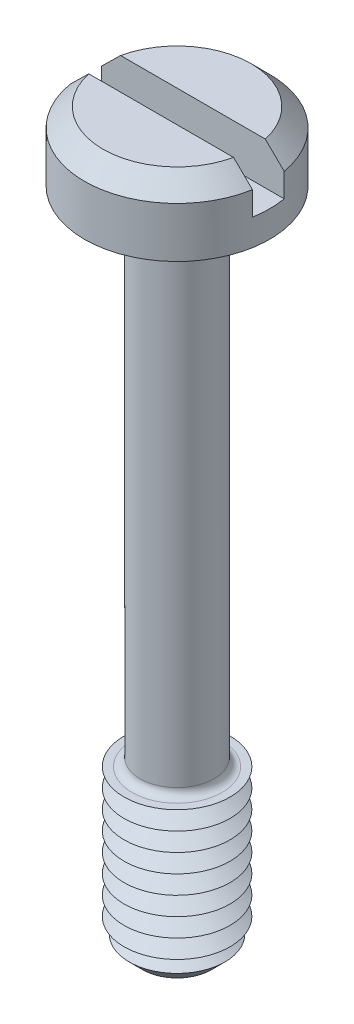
ISO-10303-21;
HEADER;
FILE_DESCRIPTION(('STEP AP214'),'2;1');
FILE_NAME('part.step','',(''),(''),'','','');
FILE_SCHEMA(('AUTOMOTIVE_DESIGN { 1 0 10303 214 1 1 1 1 }'));
ENDSEC;
DATA;
#1=APPLICATION_CONTEXT('core data for automotive mechanical design processes');
#2=APPLICATION_PROTOCOL_DEFINITION('international standard','automotive_design',2000,#1);
#3=PRODUCT_CONTEXT('',#1,'mechanical');
#4=PRODUCT('Part','Part','',(#3));
#5=PRODUCT_RELATED_PRODUCT_CATEGORY('part','',(#4));
#6=PRODUCT_DEFINITION_FORMATION('','',#4);
#7=PRODUCT_DEFINITION_CONTEXT('part definition',#1,'design');
#8=PRODUCT_DEFINITION('design','',#6,#7);
#9=PRODUCT_DEFINITION_SHAPE('','',#8);
#10=(LENGTH_UNIT() NAMED_UNIT(*) SI_UNIT(.MILLI.,.METRE.));
#11=(NAMED_UNIT(*) PLANE_ANGLE_UNIT() SI_UNIT($,.RADIAN.));
#12=(NAMED_UNIT(*) SI_UNIT($,.STERADIAN.) SOLID_ANGLE_UNIT());
#13=UNCERTAINTY_MEASURE_WITH_UNIT(LENGTH_MEASURE(1.E-05),#10,'distance_accuracy_value','');
#14=(GEOMETRIC_REPRESENTATION_CONTEXT(3) GLOBAL_UNCERTAINTY_ASSIGNED_CONTEXT((#13)) GLOBAL_UNIT_ASSIGNED_CONTEXT((#10,
#11,#12)) REPRESENTATION_CONTEXT('',''));
#15=CARTESIAN_POINT('',(0.,0.,0.));
#16=DIRECTION('',(0.,0.,1.));
#17=DIRECTION('',(1.,0.,0.));
#18=AXIS2_PLACEMENT_3D('',#15,#16,#17);
#19=CARTESIAN_POINT('',(0.,2.6,0.));
#20=DIRECTION('',(0.,1.,0.));
#21=DIRECTION('',(0.,0.,1.));
#22=AXIS2_PLACEMENT_3D('',#19,#20,#21);
#23=PLANE('',#22);
#24=DIRECTION('',(-1.,0.,0.));
#25=VECTOR('',#24,1.);
#26=CARTESIAN_POINT('',(3.5,2.6,-0.6));
#27=LINE('',#26,#25);
#28=CARTESIAN_POINT('',(2.73495886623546,2.6,-0.6));
#29=VERTEX_POINT('',#28);
#30=CARTESIAN_POINT('',(-2.73495886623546,2.6,-0.6));
#31=VERTEX_POINT('',#30);
#32=EDGE_CURVE('E110',#29,#31,#27,.T.);
#33=ORIENTED_EDGE('',*,*,#32,.F.);
#34=CARTESIAN_POINT('',(0.,2.6,0.));
#35=DIRECTION('',(0.,1.,0.));
#36=DIRECTION('',(0.,0.,1.));
#37=AXIS2_PLACEMENT_3D('',#34,#35,#36);
#38=CIRCLE('',#37,2.79999999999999);
#39=EDGE_CURVE('E113',#29,#31,#38,.T.);
#40=ORIENTED_EDGE('',*,*,#39,.T.);
#41=EDGE_LOOP('',(#33,#40));
#42=FACE_BOUND('',#41,.T.);
#43=ADVANCED_FACE('F39',(#42),#23,.T.);
#44=CARTESIAN_POINT('',(0.,2.6,0.));
#45=DIRECTION('',(0.,-1.,0.));
#46=DIRECTION('',(0.,0.,-1.));
#47=AXIS2_PLACEMENT_3D('',#44,#45,#46);
#48=CONICAL_SURFACE('',#47,2.79999999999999,0.785398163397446);
#49=CARTESIAN_POINT('',(7.69779986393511,-2.32114776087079,-0.6));
#50=CARTESIAN_POINT('',(7.42456340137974,-2.04874480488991,-0.6));
#51=CARTESIAN_POINT('',(7.15128998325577,-1.77637887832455,-0.6));
#52=CARTESIAN_POINT('',(6.6046077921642,-1.23176088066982,-0.6));
#53=CARTESIAN_POINT('',(6.3311990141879,-0.959508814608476,-0.6));
#54=CARTESIAN_POINT('',(5.78393918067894,-0.414914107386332,-0.6));
#55=CARTESIAN_POINT('',(5.51008795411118,-0.142571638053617,-0.6));
#56=CARTESIAN_POINT('',(4.96212493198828,0.401829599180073,-0.6));
#57=CARTESIAN_POINT('',(4.68801314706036,0.673888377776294,-0.6));
#58=CARTESIAN_POINT('',(4.15230810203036,1.204717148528,-0.6));
#59=CARTESIAN_POINT('',(3.8907352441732,1.4635077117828,-0.6));
#60=CARTESIAN_POINT('',(3.49781694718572,1.85115830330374,-0.6));
#61=CARTESIAN_POINT('',(3.36674319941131,1.98029362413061,-0.6));
#62=CARTESIAN_POINT('',(3.10433907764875,2.23830030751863,-0.6));
#63=CARTESIAN_POINT('',(2.97300870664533,2.36717167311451,-0.6));
#64=CARTESIAN_POINT('',(2.71005235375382,2.62445652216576,-0.6));
#65=CARTESIAN_POINT('',(2.57842659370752,2.75287023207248,-0.6));
#66=CARTESIAN_POINT('',(2.31459302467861,3.00911021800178,-0.6));
#67=CARTESIAN_POINT('',(2.1823851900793,3.13693646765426,-0.6));
#68=CARTESIAN_POINT('',(1.91706128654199,3.39159289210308,-0.6));
#69=CARTESIAN_POINT('',(1.78394541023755,3.51842326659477,-0.6));
#70=CARTESIAN_POINT('',(1.58297454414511,3.70728046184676,-0.6));
#71=CARTESIAN_POINT('',(1.51577053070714,3.76999922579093,-0.6));
#72=CARTESIAN_POINT('',(1.38073587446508,3.89475766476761,-0.6));
#73=CARTESIAN_POINT('',(1.31290524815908,3.95679735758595,-0.6));
#74=CARTESIAN_POINT('',(1.20662362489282,4.05253127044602,-0.6));
#75=CARTESIAN_POINT('',(1.16849592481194,4.08658409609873,-0.6));
#76=CARTESIAN_POINT('',(1.09186306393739,4.15427097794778,-0.6));
#77=CARTESIAN_POINT('',(1.05335786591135,4.18790499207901,-0.6));
#78=CARTESIAN_POINT('',(0.97556016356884,4.25487029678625,-0.6));
#79=CARTESIAN_POINT('',(0.936263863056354,4.28819718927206,-0.6));
#80=CARTESIAN_POINT('',(0.85702368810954,4.3540539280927,-0.6));
#81=CARTESIAN_POINT('',(0.817079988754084,4.38658398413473,-0.6));
#82=CARTESIAN_POINT('',(0.735932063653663,4.45080389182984,-0.6));
#83=CARTESIAN_POINT('',(0.694719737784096,4.48248357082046,-0.6));
#84=CARTESIAN_POINT('',(0.611023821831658,4.54411116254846,-0.6));
#85=CARTESIAN_POINT('',(0.568540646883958,4.5740596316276,-0.6));
#86=CARTESIAN_POINT('',(0.482031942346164,4.63104137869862,-0.6));
#87=CARTESIAN_POINT('',(0.438018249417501,4.65809235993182,-0.6));
#88=CARTESIAN_POINT('',(0.347545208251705,4.70764477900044,-0.6));
#89=CARTESIAN_POINT('',(0.301093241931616,4.73015905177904,-0.6));
#90=CARTESIAN_POINT('',(0.216840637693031,4.76288589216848,-0.6));
#91=CARTESIAN_POINT('',(0.179711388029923,4.77476119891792,-0.6));
#92=CARTESIAN_POINT('',(0.104069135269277,4.79214056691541,-0.6));
#93=CARTESIAN_POINT('',(0.0655630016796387,4.79767265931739,-0.6));
#94=CARTESIAN_POINT('',(-0.0121083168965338,4.80113734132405,-0.6));
#95=CARTESIAN_POINT('',(-0.0512762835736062,4.79901215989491,-0.6));
#96=CARTESIAN_POINT('',(-0.128601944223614,4.78758103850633,-0.6));
#97=CARTESIAN_POINT('',(-0.166755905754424,4.77825158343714,-0.6));
#98=CARTESIAN_POINT('',(-0.23998525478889,4.75468984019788,-0.6));
#99=CARTESIAN_POINT('',(-0.27512131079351,4.74063623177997,-0.6));
#100=CARTESIAN_POINT('',(-0.343859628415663,4.70912771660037,-0.6));
#101=CARTESIAN_POINT('',(-0.377459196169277,4.6916670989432,-0.6));
#102=CARTESIAN_POINT('',(-0.443620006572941,4.65431398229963,-0.6));
#103=CARTESIAN_POINT('',(-0.476170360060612,4.63440256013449,-0.6));
#104=CARTESIAN_POINT('',(-0.540208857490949,4.59301144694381,-0.6));
#105=CARTESIAN_POINT('',(-0.571697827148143,4.57153301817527,-0.6));
#106=CARTESIAN_POINT('',(-0.636426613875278,4.5256571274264,-0.6));
#107=CARTESIAN_POINT('',(-0.669598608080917,4.50116466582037,-0.6));
#108=CARTESIAN_POINT('',(-0.735238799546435,4.45125092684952,-0.6));
#109=CARTESIAN_POINT('',(-0.767706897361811,4.42582951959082,-0.6));
#110=CARTESIAN_POINT('',(-0.864340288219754,4.34853769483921,-0.6));
#111=CARTESIAN_POINT('',(-0.927700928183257,4.29566444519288,-0.6));
#112=CARTESIAN_POINT('',(-1.05322030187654,4.18829389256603,-0.6));
#113=CARTESIAN_POINT('',(-1.115376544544,4.13379371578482,-0.6));
#114=CARTESIAN_POINT('',(-1.23879800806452,4.02383276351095,-0.6));
#115=CARTESIAN_POINT('',(-1.30006349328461,3.96837228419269,-0.6));
#116=CARTESIAN_POINT('',(-1.42182653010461,3.85695373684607,-0.6));
#117=CARTESIAN_POINT('',(-1.48232573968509,3.80099747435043,-0.6));
#118=CARTESIAN_POINT('',(-1.60290045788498,3.68862177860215,-0.6));
#119=CARTESIAN_POINT('',(-1.66297593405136,3.63220231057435,-0.6));
#120=CARTESIAN_POINT('',(-1.842594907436,3.4625819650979,-0.6));
#121=CARTESIAN_POINT('',(-1.96167258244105,3.3488883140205,-0.6));
#122=CARTESIAN_POINT('',(-2.19942862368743,3.12043467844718,-0.6));
#123=CARTESIAN_POINT('',(-2.31810499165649,3.00567262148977,-0.6));
#124=CARTESIAN_POINT('',(-2.55498513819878,2.77566147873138,-0.6));
#125=CARTESIAN_POINT('',(-2.67318891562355,2.66041239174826,-0.6));
#126=CARTESIAN_POINT('',(-3.02733776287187,2.31418176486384,-0.6));
#127=CARTESIAN_POINT('',(-3.26281496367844,2.08272206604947,-0.6));
#128=CARTESIAN_POINT('',(-3.73326607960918,1.61902814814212,-0.6));
#129=CARTESIAN_POINT('',(-3.96823963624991,1.38679356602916,-0.6));
#130=CARTESIAN_POINT('',(-4.43780370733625,0.921942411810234,-0.6));
#131=CARTESIAN_POINT('',(-4.67239422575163,0.689325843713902,-0.6));
#132=CARTESIAN_POINT('',(-5.13982382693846,0.225350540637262,-0.6));
#133=CARTESIAN_POINT('',(-5.37266445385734,-0.0060066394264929,-0.6));
#134=CARTESIAN_POINT('',(-5.8381854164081,-0.46888381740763,-0.6));
#135=CARTESIAN_POINT('',(-6.07086575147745,-0.700403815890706,-0.6));
#136=CARTESIAN_POINT('',(-6.5359692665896,-1.16341429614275,-0.6));
#137=CARTESIAN_POINT('',(-6.76839251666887,-1.39490470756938,-0.6));
#138=CARTESIAN_POINT('',(-7.23315324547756,-1.85796986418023,-0.6));
#139=CARTESIAN_POINT('',(-7.46549072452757,-2.08954460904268,-0.6));
#140=CARTESIAN_POINT('',(-7.69779986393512,-2.32114776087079,-0.6));
#141=B_SPLINE_CURVE_WITH_KNOTS('',3,(#49,#50,#51,#52,#53,#54,#55,#56,#57,#58,#59,#60,#61,#62,
#63,#64,#65,#66,#67,#68,#69,#70,#71,#72,#73,#74,#75,#76,#77,#78,#79,#80,#81,#82,#83,#84,#85,#86,
#87,#88,#89,#90,#91,#92,#93,#94,#95,#96,#97,#98,#99,#100,#101,#102,#103,#104,#105,#106,#107,
#108,#109,#110,#111,#112,#113,#114,#115,#116,#117,#118,#119,#120,#121,#122,#123,#124,#125,#126,
#127,#128,#129,#130,#131,#132,#133,#134,#135,#136,#137,#138,#139,#140),.UNSPECIFIED.,.F.,.F.,(4,
2,2,2,2,2,2,2,2,2,2,2,2,2,2,2,2,2,2,2,2,2,2,2,2,2,2,2,2,2,2,2,2,2,2,2,2,2,2,2,2,2,2,2,2,4),(0.,
1.15747738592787,2.31500139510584,3.47365747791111,4.63226817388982,5.73614050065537,
6.28814234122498,6.84013779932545,7.39180548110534,7.94349768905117,8.49507629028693,
8.7708456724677,9.04660781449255,9.19996738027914,9.35334222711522,9.50791164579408,
9.66243993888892,9.81835637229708,9.9742224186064,10.1290741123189,10.2834813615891,
10.4000294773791,10.5160605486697,10.6329688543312,10.7502603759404,10.8635386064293,
10.9770083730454,11.0914168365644,11.205734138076,11.3294140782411,11.4531113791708,
11.7006314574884,11.9486181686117,12.196529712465,12.4437540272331,12.6909970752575,
13.184904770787,13.6801705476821,14.1754375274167,15.1659939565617,16.1571087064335,
17.1482131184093,18.1329303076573,19.1176509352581,20.1017623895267,21.0858701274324),.UNSPECIFIED.);
#142=CARTESIAN_POINT('',(3.44818792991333,1.89999999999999,-0.6));
#143=VERTEX_POINT('',#142);
#144=EDGE_CURVE('E260',#143,#29,#141,.T.);
#145=ORIENTED_EDGE('',*,*,#144,.F.);
#146=CARTESIAN_POINT('',(0.,1.89999999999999,0.));
#147=DIRECTION('',(0.,1.,0.));
#148=DIRECTION('',(0.,0.,1.));
#149=AXIS2_PLACEMENT_3D('',#146,#147,#148);
#150=CIRCLE('',#149,3.5);
#151=CARTESIAN_POINT('',(-3.44818792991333,1.89999999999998,-0.6));
#152=VERTEX_POINT('',#151);
#153=EDGE_CURVE('E128',#152,#143,#150,.F.);
#154=ORIENTED_EDGE('',*,*,#153,.F.);
#155=EDGE_CURVE('E102',#31,#152,#141,.T.);
#156=ORIENTED_EDGE('',*,*,#155,.F.);
#157=ORIENTED_EDGE('',*,*,#39,.F.);
#158=EDGE_LOOP('',(#145,#154,#156,#157));
#159=FACE_BOUND('',#158,.T.);
#160=ADVANCED_FACE('F222',(#159),#48,.T.);
#161=CARTESIAN_POINT('',(0.,-25.,0.));
#162=DIRECTION('',(0.,1.,0.));
#163=DIRECTION('',(0.,0.,1.));
#164=AXIS2_PLACEMENT_3D('',#161,#162,#163);
#165=CYLINDRICAL_SURFACE('',#164,1.4);
#166=CARTESIAN_POINT('',(0.,-18.7,0.));
#167=DIRECTION('',(0.,-1.,0.));
#168=DIRECTION('',(0.,0.,-1.));
#169=AXIS2_PLACEMENT_3D('',#166,#167,#168);
#170=CIRCLE('',#169,1.4);
#171=CARTESIAN_POINT('',(0.,-18.7,-1.4));
#172=VERTEX_POINT('',#171);
#173=EDGE_CURVE('E123',#172,#172,#170,.F.);
#174=ORIENTED_EDGE('',*,*,#173,.T.);
#175=EDGE_LOOP('',(#174));
#176=FACE_BOUND('',#175,.T.);
#177=CARTESIAN_POINT('',(0.,-0.300000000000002,0.));
#178=DIRECTION('',(0.,1.,0.));
#179=DIRECTION('',(0.,0.,1.));
#180=AXIS2_PLACEMENT_3D('',#177,#178,#179);
#181=CIRCLE('',#180,1.4);
#182=CARTESIAN_POINT('',(0.,-0.300000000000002,1.4));
#183=VERTEX_POINT('',#182);
#184=EDGE_CURVE('E366',#183,#183,#181,.F.);
#185=ORIENTED_EDGE('',*,*,#184,.T.);
#186=EDGE_LOOP('',(#185));
#187=FACE_BOUND('',#186,.T.);
#188=ADVANCED_FACE('F218',(#176,#187),#165,.T.);
#189=CARTESIAN_POINT('',(0.,2.6,0.));
#190=DIRECTION('',(0.,-1.,0.));
#191=DIRECTION('',(0.,0.,-1.));
#192=AXIS2_PLACEMENT_3D('',#189,#190,#191);
#193=CYLINDRICAL_SURFACE('',#192,3.5);
#194=ORIENTED_EDGE('',*,*,#153,.T.);
#195=DIRECTION('',(0.,-1.,0.));
#196=VECTOR('',#195,1.);
#197=CARTESIAN_POINT('',(3.44818792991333,2.6,-0.6));
#198=LINE('',#197,#196);
#199=CARTESIAN_POINT('',(3.44818792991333,1.,-0.6));
#200=VERTEX_POINT('',#199);
#201=EDGE_CURVE('E64',#143,#200,#198,.T.);
#202=ORIENTED_EDGE('',*,*,#201,.T.);
#203=CARTESIAN_POINT('',(0.,1.,0.));
#204=DIRECTION('',(0.,1.,0.));
#205=DIRECTION('',(0.,0.,1.));
#206=AXIS2_PLACEMENT_3D('',#203,#204,#205);
#207=CIRCLE('',#206,3.5);
#208=CARTESIAN_POINT('',(3.44818792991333,1.,0.6));
#209=VERTEX_POINT('',#208);
#210=EDGE_CURVE('E11',#209,#200,#207,.T.);
#211=ORIENTED_EDGE('',*,*,#210,.F.);
#212=DIRECTION('',(0.,-1.,0.));
#213=VECTOR('',#212,1.);
#214=CARTESIAN_POINT('',(3.44818792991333,2.6,0.6));
#215=LINE('',#214,#213);
#216=CARTESIAN_POINT('',(3.44818792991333,1.89999999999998,0.6));
#217=VERTEX_POINT('',#216);
#218=EDGE_CURVE('E276',#209,#217,#215,.F.);
#219=ORIENTED_EDGE('',*,*,#218,.T.);
#220=CARTESIAN_POINT('',(-3.44818792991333,1.89999999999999,0.6));
#221=VERTEX_POINT('',#220);
#222=EDGE_CURVE('E120',#217,#221,#150,.F.);
#223=ORIENTED_EDGE('',*,*,#222,.T.);
#224=DIRECTION('',(0.,-1.,0.));
#225=VECTOR('',#224,1.);
#226=CARTESIAN_POINT('',(-3.44818792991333,2.6,0.6));
#227=LINE('',#226,#225);
#228=CARTESIAN_POINT('',(-3.44818792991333,1.,0.6));
#229=VERTEX_POINT('',#228);
#230=EDGE_CURVE('E96',#221,#229,#227,.T.);
#231=ORIENTED_EDGE('',*,*,#230,.T.);
#232=CARTESIAN_POINT('',(-3.44818792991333,1.,-0.6));
#233=VERTEX_POINT('',#232);
#234=EDGE_CURVE('E44',#233,#229,#207,.T.);
#235=ORIENTED_EDGE('',*,*,#234,.F.);
#236=DIRECTION('',(0.,-1.,0.));
#237=VECTOR('',#236,1.);
#238=CARTESIAN_POINT('',(-3.44818792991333,2.6,-0.6));
#239=LINE('',#238,#237);
#240=EDGE_CURVE('E281',#233,#152,#239,.F.);
#241=ORIENTED_EDGE('',*,*,#240,.T.);
#242=EDGE_LOOP('',(#194,#202,#211,#219,#223,#231,#235,#241));
#243=FACE_BOUND('',#242,.T.);
#244=CARTESIAN_POINT('',(0.,0.,0.));
#245=DIRECTION('',(0.,1.,0.));
#246=DIRECTION('',(0.,0.,1.));
#247=AXIS2_PLACEMENT_3D('',#244,#245,#246);
#248=CIRCLE('',#247,3.5);
#249=CARTESIAN_POINT('',(0.,0.,3.5));
#250=VERTEX_POINT('',#249);
#251=EDGE_CURVE('E353',#250,#250,#248,.T.);
#252=ORIENTED_EDGE('',*,*,#251,.T.);
#253=EDGE_LOOP('',(#252));
#254=FACE_BOUND('',#253,.T.);
#255=ADVANCED_FACE('F221',(#243,#254),#193,.T.);
#256=DIRECTION('',(1.,0.,0.));
#257=VECTOR('',#256,1.);
#258=CARTESIAN_POINT('',(3.5,2.6,0.6));
#259=LINE('',#258,#257);
#260=CARTESIAN_POINT('',(-2.73495886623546,2.6,0.6));
#261=VERTEX_POINT('',#260);
#262=CARTESIAN_POINT('',(2.73495886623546,2.6,0.6));
#263=VERTEX_POINT('',#262);
#264=EDGE_CURVE('E56',#261,#263,#259,.T.);
#265=ORIENTED_EDGE('',*,*,#264,.F.);
#266=EDGE_CURVE('E108',#261,#263,#38,.T.);
#267=ORIENTED_EDGE('',*,*,#266,.T.);
#268=EDGE_LOOP('',(#265,#267));
#269=FACE_BOUND('',#268,.T.);
#270=ADVANCED_FACE('F107',(#269),#23,.T.);
#271=CARTESIAN_POINT('',(0.,0.,0.));
#272=DIRECTION('',(0.,1.,0.));
#273=DIRECTION('',(0.,0.,1.));
#274=AXIS2_PLACEMENT_3D('',#271,#272,#273);
#275=PLANE('',#274);
#276=CARTESIAN_POINT('',(0.,0.,0.));
#277=DIRECTION('',(0.,1.,0.));
#278=DIRECTION('',(0.,0.,1.));
#279=AXIS2_PLACEMENT_3D('',#276,#277,#278);
#280=CIRCLE('',#279,1.7);
#281=CARTESIAN_POINT('',(0.,0.,1.7));
#282=VERTEX_POINT('',#281);
#283=EDGE_CURVE('E114',#282,#282,#280,.T.);
#284=ORIENTED_EDGE('',*,*,#283,.T.);
#285=EDGE_LOOP('',(#284));
#286=FACE_BOUND('',#285,.T.);
#287=ORIENTED_EDGE('',*,*,#251,.F.);
#288=EDGE_LOOP('',(#287));
#289=FACE_BOUND('',#288,.T.);
#290=ADVANCED_FACE('F212',(#286,#289),#275,.F.);
#291=CARTESIAN_POINT('',(0.,-19.,0.));
#292=DIRECTION('',(0.,-1.,0.));
#293=DIRECTION('',(0.,0.,-1.));
#294=AXIS2_PLACEMENT_3D('',#291,#292,#293);
#295=PLANE('',#294);
#296=CARTESIAN_POINT('',(0.,-19.,0.));
#297=DIRECTION('',(0.,-1.,0.));
#298=DIRECTION('',(0.,0.,-1.));
#299=AXIS2_PLACEMENT_3D('',#296,#297,#298);
#300=CIRCLE('',#299,1.7);
#301=CARTESIAN_POINT('',(0.,-19.,-1.7));
#302=VERTEX_POINT('',#301);
#303=EDGE_CURVE('E360',#302,#302,#300,.T.);
#304=ORIENTED_EDGE('',*,*,#303,.T.);
#305=EDGE_LOOP('',(#304));
#306=FACE_BOUND('',#305,.T.);
#307=CARTESIAN_POINT('',(0.,-19.,0.));
#308=DIRECTION('',(0.,1.,0.));
#309=DIRECTION('',(0.,0.,1.));
#310=AXIS2_PLACEMENT_3D('',#307,#308,#309);
#311=CIRCLE('',#310,2.);
#312=CARTESIAN_POINT('',(0.,-19.,2.));
#313=VERTEX_POINT('',#312);
#314=EDGE_CURVE('E349',#313,#313,#311,.T.);
#315=ORIENTED_EDGE('',*,*,#314,.T.);
#316=EDGE_LOOP('',(#315));
#317=FACE_BOUND('',#316,.T.);
#318=ADVANCED_FACE('F208',(#306,#317),#295,.F.);
#319=CARTESIAN_POINT('',(0.,-19.35,0.));
#320=DIRECTION('',(0.,1.,0.));
#321=DIRECTION('',(0.,0.,1.));
#322=AXIS2_PLACEMENT_3D('',#319,#320,#321);
#323=CONICAL_SURFACE('',#322,1.39378221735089,1.0471975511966);
#324=ORIENTED_EDGE('',*,*,#314,.F.);
#325=EDGE_LOOP('',(#324));
#326=FACE_BOUND('',#325,.T.);
#327=CARTESIAN_POINT('',(0.,-19.35,0.));
#328=DIRECTION('',(0.,1.,0.));
#329=DIRECTION('',(0.,0.,1.));
#330=AXIS2_PLACEMENT_3D('',#327,#328,#329);
#331=CIRCLE('',#330,1.39378221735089);
#332=CARTESIAN_POINT('',(0.,-19.35,1.39378221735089));
#333=VERTEX_POINT('',#332);
#334=EDGE_CURVE('E345',#333,#333,#331,.T.);
#335=ORIENTED_EDGE('',*,*,#334,.T.);
#336=EDGE_LOOP('',(#335));
#337=FACE_BOUND('',#336,.T.);
#338=ADVANCED_FACE('F204',(#326,#337),#323,.T.);
#339=CARTESIAN_POINT('',(0.,-19.7,0.));
#340=DIRECTION('',(0.,-1.,0.));
#341=DIRECTION('',(0.,0.,-1.));
#342=AXIS2_PLACEMENT_3D('',#339,#340,#341);
#343=CONICAL_SURFACE('',#342,2.,1.0471975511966);
#344=ORIENTED_EDGE('',*,*,#334,.F.);
#345=EDGE_LOOP('',(#344));
#346=FACE_BOUND('',#345,.T.);
#347=CARTESIAN_POINT('',(0.,-19.7,0.));
#348=DIRECTION('',(0.,1.,0.));
#349=DIRECTION('',(0.,0.,1.));
#350=AXIS2_PLACEMENT_3D('',#347,#348,#349);
#351=CIRCLE('',#350,2.);
#352=CARTESIAN_POINT('',(0.,-19.7,2.));
#353=VERTEX_POINT('',#352);
#354=EDGE_CURVE('E341',#353,#353,#351,.T.);
#355=ORIENTED_EDGE('',*,*,#354,.T.);
#356=EDGE_LOOP('',(#355));
#357=FACE_BOUND('',#356,.T.);
#358=ADVANCED_FACE('F200',(#346,#357),#343,.T.);
#359=CARTESIAN_POINT('',(0.,-20.05,0.));
#360=DIRECTION('',(0.,1.,0.));
#361=DIRECTION('',(0.,0.,1.));
#362=AXIS2_PLACEMENT_3D('',#359,#360,#361);
#363=CONICAL_SURFACE('',#362,1.39378221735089,1.0471975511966);
#364=ORIENTED_EDGE('',*,*,#354,.F.);
#365=EDGE_LOOP('',(#364));
#366=FACE_BOUND('',#365,.T.);
#367=CARTESIAN_POINT('',(0.,-20.05,0.));
#368=DIRECTION('',(0.,1.,0.));
#369=DIRECTION('',(0.,0.,1.));
#370=AXIS2_PLACEMENT_3D('',#367,#368,#369);
#371=CIRCLE('',#370,1.39378221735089);
#372=CARTESIAN_POINT('',(0.,-20.05,1.39378221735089));
#373=VERTEX_POINT('',#372);
#374=EDGE_CURVE('E338',#373,#373,#371,.T.);
#375=ORIENTED_EDGE('',*,*,#374,.T.);
#376=EDGE_LOOP('',(#375));
#377=FACE_BOUND('',#376,.T.);
#378=ADVANCED_FACE('F196',(#366,#377),#363,.T.);
#379=CARTESIAN_POINT('',(0.,-20.4,0.));
#380=DIRECTION('',(0.,-1.,0.));
#381=DIRECTION('',(0.,0.,-1.));
#382=AXIS2_PLACEMENT_3D('',#379,#380,#381);
#383=CONICAL_SURFACE('',#382,2.,1.0471975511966);
#384=ORIENTED_EDGE('',*,*,#374,.F.);
#385=EDGE_LOOP('',(#384));
#386=FACE_BOUND('',#385,.T.);
#387=CARTESIAN_POINT('',(0.,-20.4,0.));
#388=DIRECTION('',(0.,1.,0.));
#389=DIRECTION('',(0.,0.,1.));
#390=AXIS2_PLACEMENT_3D('',#387,#388,#389);
#391=CIRCLE('',#390,2.);
#392=CARTESIAN_POINT('',(0.,-20.4,2.));
#393=VERTEX_POINT('',#392);
#394=EDGE_CURVE('E334',#393,#393,#391,.T.);
#395=ORIENTED_EDGE('',*,*,#394,.T.);
#396=EDGE_LOOP('',(#395));
#397=FACE_BOUND('',#396,.T.);
#398=ADVANCED_FACE('F192',(#386,#397),#383,.T.);
#399=CARTESIAN_POINT('',(0.,-20.75,0.));
#400=DIRECTION('',(0.,1.,0.));
#401=DIRECTION('',(0.,0.,1.));
#402=AXIS2_PLACEMENT_3D('',#399,#400,#401);
#403=CONICAL_SURFACE('',#402,1.39378221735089,1.0471975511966);
#404=ORIENTED_EDGE('',*,*,#394,.F.);
#405=EDGE_LOOP('',(#404));
#406=FACE_BOUND('',#405,.T.);
#407=CARTESIAN_POINT('',(0.,-20.75,0.));
#408=DIRECTION('',(0.,1.,0.));
#409=DIRECTION('',(0.,0.,1.));
#410=AXIS2_PLACEMENT_3D('',#407,#408,#409);
#411=CIRCLE('',#410,1.39378221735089);
#412=CARTESIAN_POINT('',(0.,-20.75,1.39378221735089));
#413=VERTEX_POINT('',#412);
#414=EDGE_CURVE('E331',#413,#413,#411,.T.);
#415=ORIENTED_EDGE('',*,*,#414,.T.);
#416=EDGE_LOOP('',(#415));
#417=FACE_BOUND('',#416,.T.);
#418=ADVANCED_FACE('F188',(#406,#417),#403,.T.);
#419=CARTESIAN_POINT('',(0.,-21.1,0.));
#420=DIRECTION('',(0.,-1.,0.));
#421=DIRECTION('',(0.,0.,-1.));
#422=AXIS2_PLACEMENT_3D('',#419,#420,#421);
#423=CONICAL_SURFACE('',#422,2.,1.0471975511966);
#424=ORIENTED_EDGE('',*,*,#414,.F.);
#425=EDGE_LOOP('',(#424));
#426=FACE_BOUND('',#425,.T.);
#427=CARTESIAN_POINT('',(0.,-21.1,0.));
#428=DIRECTION('',(0.,1.,0.));
#429=DIRECTION('',(0.,0.,1.));
#430=AXIS2_PLACEMENT_3D('',#427,#428,#429);
#431=CIRCLE('',#430,2.);
#432=CARTESIAN_POINT('',(0.,-21.1,2.));
#433=VERTEX_POINT('',#432);
#434=EDGE_CURVE('E327',#433,#433,#431,.T.);
#435=ORIENTED_EDGE('',*,*,#434,.T.);
#436=EDGE_LOOP('',(#435));
#437=FACE_BOUND('',#436,.T.);
#438=ADVANCED_FACE('F184',(#426,#437),#423,.T.);
#439=CARTESIAN_POINT('',(0.,-21.45,0.));
#440=DIRECTION('',(0.,1.,0.));
#441=DIRECTION('',(0.,0.,1.));
#442=AXIS2_PLACEMENT_3D('',#439,#440,#441);
#443=CONICAL_SURFACE('',#442,1.39378221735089,1.0471975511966);
#444=ORIENTED_EDGE('',*,*,#434,.F.);
#445=EDGE_LOOP('',(#444));
#446=FACE_BOUND('',#445,.T.);
#447=CARTESIAN_POINT('',(0.,-21.45,0.));
#448=DIRECTION('',(0.,1.,0.));
#449=DIRECTION('',(0.,0.,1.));
#450=AXIS2_PLACEMENT_3D('',#447,#448,#449);
#451=CIRCLE('',#450,1.39378221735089);
#452=CARTESIAN_POINT('',(0.,-21.45,1.39378221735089));
#453=VERTEX_POINT('',#452);
#454=EDGE_CURVE('E324',#453,#453,#451,.T.);
#455=ORIENTED_EDGE('',*,*,#454,.T.);
#456=EDGE_LOOP('',(#455));
#457=FACE_BOUND('',#456,.T.);
#458=ADVANCED_FACE('F180',(#446,#457),#443,.T.);
#459=CARTESIAN_POINT('',(0.,-21.8,0.));
#460=DIRECTION('',(0.,-1.,0.));
#461=DIRECTION('',(0.,0.,-1.));
#462=AXIS2_PLACEMENT_3D('',#459,#460,#461);
#463=CONICAL_SURFACE('',#462,2.,1.0471975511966);
#464=ORIENTED_EDGE('',*,*,#454,.F.);
#465=EDGE_LOOP('',(#464));
#466=FACE_BOUND('',#465,.T.);
#467=CARTESIAN_POINT('',(0.,-21.8,0.));
#468=DIRECTION('',(0.,1.,0.));
#469=DIRECTION('',(0.,0.,1.));
#470=AXIS2_PLACEMENT_3D('',#467,#468,#469);
#471=CIRCLE('',#470,2.);
#472=CARTESIAN_POINT('',(0.,-21.8,2.));
#473=VERTEX_POINT('',#472);
#474=EDGE_CURVE('E320',#473,#473,#471,.T.);
#475=ORIENTED_EDGE('',*,*,#474,.T.);
#476=EDGE_LOOP('',(#475));
#477=FACE_BOUND('',#476,.T.);
#478=ADVANCED_FACE('F176',(#466,#477),#463,.T.);
#479=CARTESIAN_POINT('',(0.,-22.15,0.));
#480=DIRECTION('',(0.,1.,0.));
#481=DIRECTION('',(0.,0.,1.));
#482=AXIS2_PLACEMENT_3D('',#479,#480,#481);
#483=CONICAL_SURFACE('',#482,1.39378221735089,1.0471975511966);
#484=ORIENTED_EDGE('',*,*,#474,.F.);
#485=EDGE_LOOP('',(#484));
#486=FACE_BOUND('',#485,.T.);
#487=CARTESIAN_POINT('',(0.,-22.15,0.));
#488=DIRECTION('',(0.,1.,0.));
#489=DIRECTION('',(0.,0.,1.));
#490=AXIS2_PLACEMENT_3D('',#487,#488,#489);
#491=CIRCLE('',#490,1.39378221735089);
#492=CARTESIAN_POINT('',(0.,-22.15,1.39378221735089));
#493=VERTEX_POINT('',#492);
#494=EDGE_CURVE('E316',#493,#493,#491,.T.);
#495=ORIENTED_EDGE('',*,*,#494,.T.);
#496=EDGE_LOOP('',(#495));
#497=FACE_BOUND('',#496,.T.);
#498=ADVANCED_FACE('F172',(#486,#497),#483,.T.);
#499=CARTESIAN_POINT('',(0.,-22.5,0.));
#500=DIRECTION('',(0.,-1.,0.));
#501=DIRECTION('',(0.,0.,-1.));
#502=AXIS2_PLACEMENT_3D('',#499,#500,#501);
#503=CONICAL_SURFACE('',#502,2.,1.0471975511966);
#504=ORIENTED_EDGE('',*,*,#494,.F.);
#505=EDGE_LOOP('',(#504));
#506=FACE_BOUND('',#505,.T.);
#507=CARTESIAN_POINT('',(0.,-22.5,0.));
#508=DIRECTION('',(0.,1.,0.));
#509=DIRECTION('',(0.,0.,1.));
#510=AXIS2_PLACEMENT_3D('',#507,#508,#509);
#511=CIRCLE('',#510,2.);
#512=CARTESIAN_POINT('',(0.,-22.5,2.));
#513=VERTEX_POINT('',#512);
#514=EDGE_CURVE('E312',#513,#513,#511,.T.);
#515=ORIENTED_EDGE('',*,*,#514,.T.);
#516=EDGE_LOOP('',(#515));
#517=FACE_BOUND('',#516,.T.);
#518=ADVANCED_FACE('F168',(#506,#517),#503,.T.);
#519=CARTESIAN_POINT('',(0.,-22.85,0.));
#520=DIRECTION('',(0.,1.,0.));
#521=DIRECTION('',(0.,0.,1.));
#522=AXIS2_PLACEMENT_3D('',#519,#520,#521);
#523=CONICAL_SURFACE('',#522,1.39378221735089,1.0471975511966);
#524=ORIENTED_EDGE('',*,*,#514,.F.);
#525=EDGE_LOOP('',(#524));
#526=FACE_BOUND('',#525,.T.);
#527=CARTESIAN_POINT('',(0.,-22.85,0.));
#528=DIRECTION('',(0.,1.,0.));
#529=DIRECTION('',(0.,0.,1.));
#530=AXIS2_PLACEMENT_3D('',#527,#528,#529);
#531=CIRCLE('',#530,1.39378221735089);
#532=CARTESIAN_POINT('',(0.,-22.85,1.39378221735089));
#533=VERTEX_POINT('',#532);
#534=EDGE_CURVE('E308',#533,#533,#531,.T.);
#535=ORIENTED_EDGE('',*,*,#534,.T.);
#536=EDGE_LOOP('',(#535));
#537=FACE_BOUND('',#536,.T.);
#538=ADVANCED_FACE('F164',(#526,#537),#523,.T.);
#539=CARTESIAN_POINT('',(0.,-23.2,0.));
#540=DIRECTION('',(0.,-1.,0.));
#541=DIRECTION('',(0.,0.,-1.));
#542=AXIS2_PLACEMENT_3D('',#539,#540,#541);
#543=CONICAL_SURFACE('',#542,2.,1.0471975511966);
#544=ORIENTED_EDGE('',*,*,#534,.F.);
#545=EDGE_LOOP('',(#544));
#546=FACE_BOUND('',#545,.T.);
#547=CARTESIAN_POINT('',(0.,-23.2,0.));
#548=DIRECTION('',(0.,1.,0.));
#549=DIRECTION('',(0.,0.,1.));
#550=AXIS2_PLACEMENT_3D('',#547,#548,#549);
#551=CIRCLE('',#550,2.);
#552=CARTESIAN_POINT('',(0.,-23.2,2.));
#553=VERTEX_POINT('',#552);
#554=EDGE_CURVE('E304',#553,#553,#551,.T.);
#555=ORIENTED_EDGE('',*,*,#554,.T.);
#556=EDGE_LOOP('',(#555));
#557=FACE_BOUND('',#556,.T.);
#558=ADVANCED_FACE('F160',(#546,#557),#543,.T.);
#559=CARTESIAN_POINT('',(0.,-23.55,0.));
#560=DIRECTION('',(0.,1.,0.));
#561=DIRECTION('',(0.,0.,1.));
#562=AXIS2_PLACEMENT_3D('',#559,#560,#561);
#563=CONICAL_SURFACE('',#562,1.39378221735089,1.0471975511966);
#564=ORIENTED_EDGE('',*,*,#554,.F.);
#565=EDGE_LOOP('',(#564));
#566=FACE_BOUND('',#565,.T.);
#567=CARTESIAN_POINT('',(0.,-23.55,0.));
#568=DIRECTION('',(0.,1.,0.));
#569=DIRECTION('',(0.,0.,1.));
#570=AXIS2_PLACEMENT_3D('',#567,#568,#569);
#571=CIRCLE('',#570,1.39378221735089);
#572=CARTESIAN_POINT('',(0.,-23.55,1.39378221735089));
#573=VERTEX_POINT('',#572);
#574=EDGE_CURVE('E300',#573,#573,#571,.T.);
#575=ORIENTED_EDGE('',*,*,#574,.T.);
#576=EDGE_LOOP('',(#575));
#577=FACE_BOUND('',#576,.T.);
#578=ADVANCED_FACE('F156',(#566,#577),#563,.T.);
#579=CARTESIAN_POINT('',(0.,-23.9,0.));
#580=DIRECTION('',(0.,-1.,0.));
#581=DIRECTION('',(0.,0.,-1.));
#582=AXIS2_PLACEMENT_3D('',#579,#580,#581);
#583=CONICAL_SURFACE('',#582,2.,1.0471975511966);
#584=ORIENTED_EDGE('',*,*,#574,.F.);
#585=EDGE_LOOP('',(#584));
#586=FACE_BOUND('',#585,.T.);
#587=CARTESIAN_POINT('',(0.,-23.9,0.));
#588=DIRECTION('',(0.,1.,0.));
#589=DIRECTION('',(0.,0.,1.));
#590=AXIS2_PLACEMENT_3D('',#587,#588,#589);
#591=CIRCLE('',#590,2.);
#592=CARTESIAN_POINT('',(0.,-23.9,2.));
#593=VERTEX_POINT('',#592);
#594=EDGE_CURVE('E295',#593,#593,#591,.T.);
#595=ORIENTED_EDGE('',*,*,#594,.T.);
#596=EDGE_LOOP('',(#595));
#597=FACE_BOUND('',#596,.T.);
#598=ADVANCED_FACE('F152',(#586,#597),#583,.T.);
#599=CARTESIAN_POINT('',(0.,-24.25,0.));
#600=DIRECTION('',(0.,1.,0.));
#601=DIRECTION('',(0.,0.,1.));
#602=AXIS2_PLACEMENT_3D('',#599,#600,#601);
#603=CONICAL_SURFACE('',#602,1.39378221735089,1.0471975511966);
#604=ORIENTED_EDGE('',*,*,#594,.F.);
#605=EDGE_LOOP('',(#604));
#606=FACE_BOUND('',#605,.T.);
#607=CARTESIAN_POINT('',(0.,-24.25,0.));
#608=DIRECTION('',(0.,1.,0.));
#609=DIRECTION('',(0.,0.,1.));
#610=AXIS2_PLACEMENT_3D('',#607,#608,#609);
#611=CIRCLE('',#610,1.39378221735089);
#612=CARTESIAN_POINT('',(0.,-24.25,1.39378221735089));
#613=VERTEX_POINT('',#612);
#614=EDGE_CURVE('E291',#613,#613,#611,.T.);
#615=ORIENTED_EDGE('',*,*,#614,.T.);
#616=EDGE_LOOP('',(#615));
#617=FACE_BOUND('',#616,.T.);
#618=ADVANCED_FACE('F148',(#606,#617),#603,.T.);
#619=CARTESIAN_POINT('',(0.,-24.6,0.));
#620=DIRECTION('',(0.,-1.,0.));
#621=DIRECTION('',(0.,0.,-1.));
#622=AXIS2_PLACEMENT_3D('',#619,#620,#621);
#623=CONICAL_SURFACE('',#622,2.,1.0471975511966);
#624=CARTESIAN_POINT('',(0.,-24.4901923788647,0.));
#625=DIRECTION('',(0.,-1.,0.));
#626=DIRECTION('',(0.,0.,-1.));
#627=AXIS2_PLACEMENT_3D('',#624,#625,#626);
#628=CIRCLE('',#627,1.80980762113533);
#629=CARTESIAN_POINT('',(0.,-24.4901923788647,-1.80980762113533));
#630=VERTEX_POINT('',#629);
#631=EDGE_CURVE('E299',#630,#630,#628,.F.);
#632=ORIENTED_EDGE('',*,*,#631,.T.);
#633=EDGE_LOOP('',(#632));
#634=FACE_BOUND('',#633,.T.);
#635=ORIENTED_EDGE('',*,*,#614,.F.);
#636=EDGE_LOOP('',(#635));
#637=FACE_BOUND('',#636,.T.);
#638=ADVANCED_FACE('F144',(#634,#637),#623,.T.);
#639=CARTESIAN_POINT('',(0.,-25.,0.));
#640=DIRECTION('',(0.,-1.,0.));
#641=DIRECTION('',(0.,0.,-1.));
#642=AXIS2_PLACEMENT_3D('',#639,#640,#641);
#643=PLANE('',#642);
#644=CARTESIAN_POINT('',(0.,-25.,0.));
#645=DIRECTION('',(0.,-1.,0.));
#646=DIRECTION('',(0.,0.,-1.));
#647=AXIS2_PLACEMENT_3D('',#644,#645,#646);
#648=CIRCLE('',#647,1.3);
#649=CARTESIAN_POINT('',(0.,-25.,-1.3));
#650=VERTEX_POINT('',#649);
#651=EDGE_CURVE('E357',#650,#650,#648,.T.);
#652=ORIENTED_EDGE('',*,*,#651,.T.);
#653=EDGE_LOOP('',(#652));
#654=FACE_BOUND('',#653,.T.);
#655=ADVANCED_FACE('F147',(#654),#643,.T.);
#656=CARTESIAN_POINT('',(0.,-25.,0.));
#657=DIRECTION('',(0.,1.,0.));
#658=DIRECTION('',(0.,0.,1.));
#659=AXIS2_PLACEMENT_3D('',#656,#657,#658);
#660=CONICAL_SURFACE('',#659,1.3,0.785398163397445);
#661=ORIENTED_EDGE('',*,*,#631,.F.);
#662=EDGE_LOOP('',(#661));
#663=FACE_BOUND('',#662,.T.);
#664=ORIENTED_EDGE('',*,*,#651,.F.);
#665=EDGE_LOOP('',(#664));
#666=FACE_BOUND('',#665,.T.);
#667=ADVANCED_FACE('F216',(#663,#666),#660,.T.);
#668=CARTESIAN_POINT('',(0.,-18.7,0.));
#669=DIRECTION('',(0.,-1.,0.));
#670=DIRECTION('',(0.,0.,-1.));
#671=AXIS2_PLACEMENT_3D('',#668,#669,#670);
#672=TOROIDAL_SURFACE('',#671,1.7,0.3);
#673=ORIENTED_EDGE('',*,*,#173,.F.);
#674=EDGE_LOOP('',(#673));
#675=FACE_BOUND('',#674,.T.);
#676=ORIENTED_EDGE('',*,*,#303,.F.);
#677=EDGE_LOOP('',(#676));
#678=FACE_BOUND('',#677,.T.);
#679=ADVANCED_FACE('F234',(#675,#678),#672,.F.);
#680=CARTESIAN_POINT('',(0.,-0.300000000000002,0.));
#681=DIRECTION('',(0.,1.,0.));
#682=DIRECTION('',(0.,0.,1.));
#683=AXIS2_PLACEMENT_3D('',#680,#681,#682);
#684=TOROIDAL_SURFACE('',#683,1.7,0.3);
#685=ORIENTED_EDGE('',*,*,#283,.F.);
#686=EDGE_LOOP('',(#685));
#687=FACE_BOUND('',#686,.T.);
#688=ORIENTED_EDGE('',*,*,#184,.F.);
#689=EDGE_LOOP('',(#688));
#690=FACE_BOUND('',#689,.T.);
#691=ADVANCED_FACE('F237',(#687,#690),#684,.F.);
#692=CARTESIAN_POINT('',(-7.69779986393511,-2.32114776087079,0.6));
#693=CARTESIAN_POINT('',(-7.42456340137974,-2.04874480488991,0.6));
#694=CARTESIAN_POINT('',(-7.15128998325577,-1.77637887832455,0.6));
#695=CARTESIAN_POINT('',(-6.6046077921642,-1.23176088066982,0.6));
#696=CARTESIAN_POINT('',(-6.3311990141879,-0.959508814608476,0.6));
#697=CARTESIAN_POINT('',(-5.78393918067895,-0.414914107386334,0.6));
#698=CARTESIAN_POINT('',(-5.51008795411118,-0.14257163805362,0.6));
#699=CARTESIAN_POINT('',(-4.96212493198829,0.40182959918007,0.6));
#700=CARTESIAN_POINT('',(-4.68801314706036,0.673888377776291,0.6));
#701=CARTESIAN_POINT('',(-4.15230810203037,1.204717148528,0.6));
#702=CARTESIAN_POINT('',(-3.89073524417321,1.4635077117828,0.6));
#703=CARTESIAN_POINT('',(-3.49781694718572,1.85115830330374,0.6));
#704=CARTESIAN_POINT('',(-3.36674319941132,1.98029362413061,0.6));
#705=CARTESIAN_POINT('',(-3.10433907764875,2.23830030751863,0.6));
#706=CARTESIAN_POINT('',(-2.97300870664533,2.36717167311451,0.6));
#707=CARTESIAN_POINT('',(-2.71005235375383,2.62445652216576,0.6));
#708=CARTESIAN_POINT('',(-2.57842659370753,2.75287023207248,0.6));
#709=CARTESIAN_POINT('',(-2.31459302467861,3.00911021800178,0.6));
#710=CARTESIAN_POINT('',(-2.1823851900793,3.13693646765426,0.6));
#711=CARTESIAN_POINT('',(-1.91706128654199,3.39159289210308,0.6));
#712=CARTESIAN_POINT('',(-1.78394541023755,3.51842326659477,0.6));
#713=CARTESIAN_POINT('',(-1.5829745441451,3.70728046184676,0.6));
#714=CARTESIAN_POINT('',(-1.51577053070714,3.76999922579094,0.6));
#715=CARTESIAN_POINT('',(-1.38073587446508,3.89475766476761,0.6));
#716=CARTESIAN_POINT('',(-1.31290524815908,3.95679735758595,0.6));
#717=CARTESIAN_POINT('',(-1.20662362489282,4.05253127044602,0.6));
#718=CARTESIAN_POINT('',(-1.16849592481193,4.08658409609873,0.6));
#719=CARTESIAN_POINT('',(-1.09186306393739,4.15427097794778,0.6));
#720=CARTESIAN_POINT('',(-1.05335786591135,4.18790499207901,0.6));
#721=CARTESIAN_POINT('',(-0.97556016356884,4.25487029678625,0.6));
#722=CARTESIAN_POINT('',(-0.936263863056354,4.28819718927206,0.6));
#723=CARTESIAN_POINT('',(-0.85702368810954,4.3540539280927,0.6));
#724=CARTESIAN_POINT('',(-0.817079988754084,4.38658398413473,0.6));
#725=CARTESIAN_POINT('',(-0.735932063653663,4.45080389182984,0.6));
#726=CARTESIAN_POINT('',(-0.694719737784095,4.48248357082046,0.6));
#727=CARTESIAN_POINT('',(-0.611023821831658,4.54411116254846,0.6));
#728=CARTESIAN_POINT('',(-0.568540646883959,4.5740596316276,0.6));
#729=CARTESIAN_POINT('',(-0.482031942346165,4.63104137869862,0.6));
#730=CARTESIAN_POINT('',(-0.438018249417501,4.65809235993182,0.6));
#731=CARTESIAN_POINT('',(-0.347545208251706,4.70764477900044,0.6));
#732=CARTESIAN_POINT('',(-0.301093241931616,4.73015905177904,0.6));
#733=CARTESIAN_POINT('',(-0.216840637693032,4.76288589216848,0.6));
#734=CARTESIAN_POINT('',(-0.179711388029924,4.77476119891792,0.6));
#735=CARTESIAN_POINT('',(-0.104069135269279,4.79214056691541,0.6));
#736=CARTESIAN_POINT('',(-0.0655630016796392,4.79767265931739,0.6));
#737=CARTESIAN_POINT('',(0.0121083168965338,4.80113734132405,0.6));
#738=CARTESIAN_POINT('',(0.0512762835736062,4.79901215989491,0.6));
#739=CARTESIAN_POINT('',(0.128601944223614,4.78758103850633,0.6));
#740=CARTESIAN_POINT('',(0.166755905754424,4.77825158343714,0.6));
#741=CARTESIAN_POINT('',(0.23998525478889,4.75468984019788,0.6));
#742=CARTESIAN_POINT('',(0.275121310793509,4.74063623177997,0.6));
#743=CARTESIAN_POINT('',(0.343859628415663,4.70912771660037,0.6));
#744=CARTESIAN_POINT('',(0.377459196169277,4.6916670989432,0.6));
#745=CARTESIAN_POINT('',(0.44362000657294,4.65431398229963,0.6));
#746=CARTESIAN_POINT('',(0.476170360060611,4.63440256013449,0.6));
#747=CARTESIAN_POINT('',(0.540208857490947,4.59301144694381,0.6));
#748=CARTESIAN_POINT('',(0.571697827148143,4.57153301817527,0.6));
#749=CARTESIAN_POINT('',(0.636426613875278,4.5256571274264,0.6));
#750=CARTESIAN_POINT('',(0.669598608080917,4.50116466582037,0.6));
#751=CARTESIAN_POINT('',(0.735238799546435,4.45125092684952,0.6));
#752=CARTESIAN_POINT('',(0.767706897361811,4.42582951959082,0.6));
#753=CARTESIAN_POINT('',(0.864340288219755,4.34853769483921,0.6));
#754=CARTESIAN_POINT('',(0.927700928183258,4.29566444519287,0.6));
#755=CARTESIAN_POINT('',(1.05322030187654,4.18829389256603,0.6));
#756=CARTESIAN_POINT('',(1.11537654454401,4.13379371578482,0.6));
#757=CARTESIAN_POINT('',(1.23879800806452,4.02383276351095,0.6));
#758=CARTESIAN_POINT('',(1.30006349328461,3.96837228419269,0.6));
#759=CARTESIAN_POINT('',(1.42182653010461,3.85695373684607,0.6));
#760=CARTESIAN_POINT('',(1.48232573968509,3.80099747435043,0.6));
#761=CARTESIAN_POINT('',(1.60290045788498,3.68862177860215,0.6));
#762=CARTESIAN_POINT('',(1.66297593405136,3.63220231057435,0.6));
#763=CARTESIAN_POINT('',(1.842594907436,3.4625819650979,0.6));
#764=CARTESIAN_POINT('',(1.96167258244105,3.3488883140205,0.6));
#765=CARTESIAN_POINT('',(2.19942862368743,3.12043467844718,0.6));
#766=CARTESIAN_POINT('',(2.31810499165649,3.00567262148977,0.6));
#767=CARTESIAN_POINT('',(2.55498513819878,2.77566147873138,0.6));
#768=CARTESIAN_POINT('',(2.67318891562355,2.66041239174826,0.6));
#769=CARTESIAN_POINT('',(3.02733776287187,2.31418176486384,0.6));
#770=CARTESIAN_POINT('',(3.26281496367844,2.08272206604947,0.6));
#771=CARTESIAN_POINT('',(3.73326607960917,1.61902814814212,0.6));
#772=CARTESIAN_POINT('',(3.96823963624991,1.38679356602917,0.6));
#773=CARTESIAN_POINT('',(4.43780370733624,0.921942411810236,0.6));
#774=CARTESIAN_POINT('',(4.67239422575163,0.689325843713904,0.6));
#775=CARTESIAN_POINT('',(5.13982382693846,0.225350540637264,0.6));
#776=CARTESIAN_POINT('',(5.37266445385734,-0.00600663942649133,0.6));
#777=CARTESIAN_POINT('',(5.8381854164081,-0.468883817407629,0.6));
#778=CARTESIAN_POINT('',(6.07086575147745,-0.700403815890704,0.6));
#779=CARTESIAN_POINT('',(6.5359692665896,-1.16341429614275,0.6));
#780=CARTESIAN_POINT('',(6.76839251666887,-1.39490470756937,0.6));
#781=CARTESIAN_POINT('',(7.23315324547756,-1.85796986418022,0.6));
#782=CARTESIAN_POINT('',(7.46549072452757,-2.08954460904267,0.6));
#783=CARTESIAN_POINT('',(7.69779986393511,-2.32114776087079,0.6));
#784=B_SPLINE_CURVE_WITH_KNOTS('',3,(#692,#693,#694,#695,#696,#697,#698,#699,#700,#701,#702,
#703,#704,#705,#706,#707,#708,#709,#710,#711,#712,#713,#714,#715,#716,#717,#718,#719,#720,#721,
#722,#723,#724,#725,#726,#727,#728,#729,#730,#731,#732,#733,#734,#735,#736,#737,#738,#739,#740,
#741,#742,#743,#744,#745,#746,#747,#748,#749,#750,#751,#752,#753,#754,#755,#756,#757,#758,#759,
#760,#761,#762,#763,#764,#765,#766,#767,#768,#769,#770,#771,#772,#773,#774,#775,#776,#777,#778,
#779,#780,#781,#782,#783),.UNSPECIFIED.,.F.,.F.,(4,2,2,2,2,2,2,2,2,2,2,2,2,2,2,2,2,2,2,2,2,2,2,
2,2,2,2,2,2,2,2,2,2,2,2,2,2,2,2,2,2,2,2,2,2,4),(0.,1.15747738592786,2.31500139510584,
3.4736574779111,4.63226817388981,5.73614050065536,6.28814234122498,6.84013779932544,
7.39180548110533,7.94349768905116,8.49507629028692,8.7708456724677,9.04660781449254,
9.19996738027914,9.35334222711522,9.50791164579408,9.66243993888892,9.81835637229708,
9.97422241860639,10.1290741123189,10.2834813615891,10.4000294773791,10.5160605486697,
10.6329688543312,10.7502603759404,10.8635386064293,10.9770083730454,11.0914168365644,
11.205734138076,11.3294140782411,11.4531113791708,11.7006314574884,11.9486181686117,
12.196529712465,12.4437540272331,12.6909970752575,13.184904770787,13.6801705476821,
14.1754375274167,15.1659939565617,16.1571087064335,17.1482131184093,18.1329303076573,
19.1176509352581,20.1017623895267,21.0858701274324),.UNSPECIFIED.);
#785=EDGE_CURVE('E92',#221,#261,#784,.T.);
#786=ORIENTED_EDGE('',*,*,#785,.F.);
#787=ORIENTED_EDGE('',*,*,#222,.F.);
#788=EDGE_CURVE('E103',#263,#217,#784,.T.);
#789=ORIENTED_EDGE('',*,*,#788,.F.);
#790=ORIENTED_EDGE('',*,*,#266,.F.);
#791=EDGE_LOOP('',(#786,#787,#789,#790));
#792=FACE_BOUND('',#791,.T.);
#793=ADVANCED_FACE('F41',(#792),#48,.T.);
#794=CARTESIAN_POINT('',(0.,1.,0.));
#795=DIRECTION('',(0.,1.,0.));
#796=DIRECTION('',(0.,0.,1.));
#797=AXIS2_PLACEMENT_3D('',#794,#795,#796);
#798=PLANE('',#797);
#799=DIRECTION('',(1.,0.,0.));
#800=VECTOR('',#799,1.);
#801=CARTESIAN_POINT('',(3.5,1.,0.6));
#802=LINE('',#801,#800);
#803=EDGE_CURVE('E257',#229,#209,#802,.T.);
#804=ORIENTED_EDGE('',*,*,#803,.T.);
#805=ORIENTED_EDGE('',*,*,#210,.T.);
#806=DIRECTION('',(-1.,0.,0.));
#807=VECTOR('',#806,1.);
#808=CARTESIAN_POINT('',(3.5,1.,-0.6));
#809=LINE('',#808,#807);
#810=EDGE_CURVE('E273',#200,#233,#809,.T.);
#811=ORIENTED_EDGE('',*,*,#810,.T.);
#812=ORIENTED_EDGE('',*,*,#234,.T.);
#813=EDGE_LOOP('',(#804,#805,#811,#812));
#814=FACE_BOUND('',#813,.T.);
#815=ADVANCED_FACE('F244',(#814),#798,.T.);
#816=CARTESIAN_POINT('',(3.5,1.,-0.6));
#817=DIRECTION('',(0.,0.,-1.));
#818=DIRECTION('',(-1.,0.,0.));
#819=AXIS2_PLACEMENT_3D('',#816,#817,#818);
#820=PLANE('',#819);
#821=ORIENTED_EDGE('',*,*,#144,.T.);
#822=ORIENTED_EDGE('',*,*,#32,.T.);
#823=ORIENTED_EDGE('',*,*,#155,.T.);
#824=ORIENTED_EDGE('',*,*,#240,.F.);
#825=ORIENTED_EDGE('',*,*,#810,.F.);
#826=ORIENTED_EDGE('',*,*,#201,.F.);
#827=EDGE_LOOP('',(#821,#822,#823,#824,#825,#826));
#828=FACE_BOUND('',#827,.T.);
#829=ADVANCED_FACE('F141',(#828),#820,.F.);
#830=CARTESIAN_POINT('',(3.5,1.,0.6));
#831=DIRECTION('',(0.,0.,1.));
#832=DIRECTION('',(1.,0.,0.));
#833=AXIS2_PLACEMENT_3D('',#830,#831,#832);
#834=PLANE('',#833);
#835=ORIENTED_EDGE('',*,*,#785,.T.);
#836=ORIENTED_EDGE('',*,*,#264,.T.);
#837=ORIENTED_EDGE('',*,*,#788,.T.);
#838=ORIENTED_EDGE('',*,*,#218,.F.);
#839=ORIENTED_EDGE('',*,*,#803,.F.);
#840=ORIENTED_EDGE('',*,*,#230,.F.);
#841=EDGE_LOOP('',(#835,#836,#837,#838,#839,#840));
#842=FACE_BOUND('',#841,.T.);
#843=ADVANCED_FACE('F93',(#842),#834,.F.);
#844=CLOSED_SHELL('',(#43,#160,#188,#255,#270,#290,#318,#338,#358,#378,#398,#418,#438,#458,#478,
#498,#518,#538,#558,#578,#598,#618,#638,#655,#667,#679,#691,#793,#815,#829,#843));
#845=MANIFOLD_SOLID_BREP('B2',#844);
#846=ADVANCED_BREP_SHAPE_REPRESENTATION('',(#18,#845),#14);
#847=SHAPE_DEFINITION_REPRESENTATION(#9,#846);
ENDSEC;
END-ISO-10303-21;
